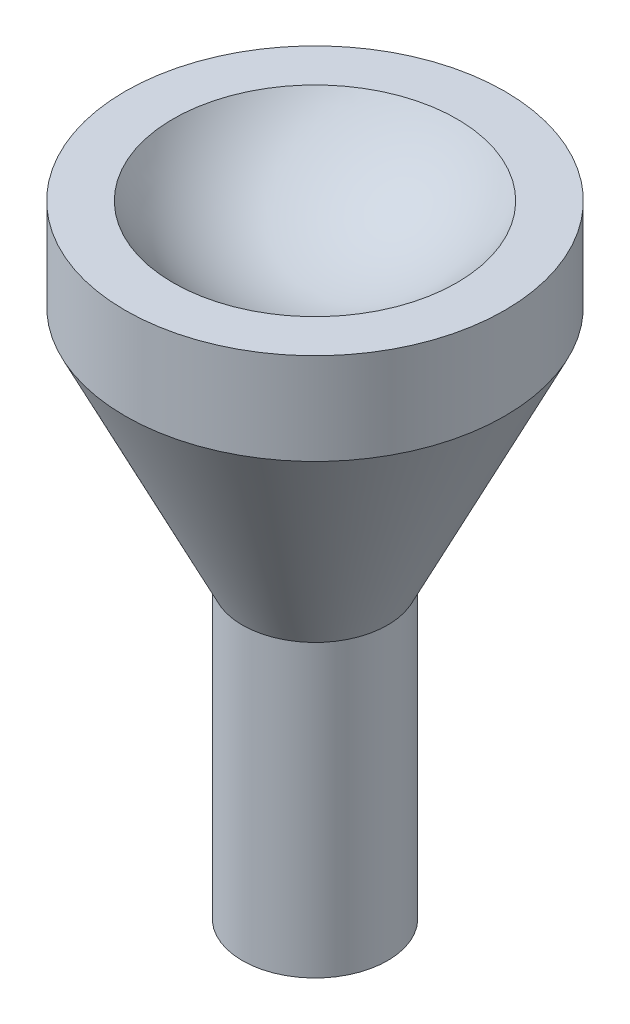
ISO-10303-21;
HEADER;
FILE_DESCRIPTION(('STEP AP214'),'2;1');
FILE_NAME('part.step','',(''),(''),'','','');
FILE_SCHEMA(('AUTOMOTIVE_DESIGN { 1 0 10303 214 1 1 1 1 }'));
ENDSEC;
DATA;
#1=APPLICATION_CONTEXT('core data for automotive mechanical design processes');
#2=APPLICATION_PROTOCOL_DEFINITION('international standard','automotive_design',2000,#1);
#3=PRODUCT_CONTEXT('',#1,'mechanical');
#4=PRODUCT('Part','Part','',(#3));
#5=PRODUCT_RELATED_PRODUCT_CATEGORY('part','',(#4));
#6=PRODUCT_DEFINITION_FORMATION('','',#4);
#7=PRODUCT_DEFINITION_CONTEXT('part definition',#1,'design');
#8=PRODUCT_DEFINITION('design','',#6,#7);
#9=PRODUCT_DEFINITION_SHAPE('','',#8);
#10=(LENGTH_UNIT() NAMED_UNIT(*) SI_UNIT(.MILLI.,.METRE.));
#11=(NAMED_UNIT(*) PLANE_ANGLE_UNIT() SI_UNIT($,.RADIAN.));
#12=(NAMED_UNIT(*) SI_UNIT($,.STERADIAN.) SOLID_ANGLE_UNIT());
#13=UNCERTAINTY_MEASURE_WITH_UNIT(LENGTH_MEASURE(1.E-05),#10,'distance_accuracy_value','');
#14=(GEOMETRIC_REPRESENTATION_CONTEXT(3) GLOBAL_UNCERTAINTY_ASSIGNED_CONTEXT((#13)) GLOBAL_UNIT_ASSIGNED_CONTEXT((#10,
#11,#12)) REPRESENTATION_CONTEXT('',''));
#15=CARTESIAN_POINT('',(0.,0.,0.));
#16=DIRECTION('',(0.,0.,1.));
#17=DIRECTION('',(1.,0.,0.));
#18=AXIS2_PLACEMENT_3D('',#15,#16,#17);
#19=CARTESIAN_POINT('',(0.,0.,0.));
#20=DIRECTION('',(0.,1.,0.));
#21=DIRECTION('',(0.,0.,1.));
#22=AXIS2_PLACEMENT_3D('',#19,#20,#21);
#23=PLANE('',#22);
#24=CARTESIAN_POINT('',(0.,0.,0.));
#25=DIRECTION('',(0.,1.,0.));
#26=DIRECTION('',(0.,0.,1.));
#27=AXIS2_PLACEMENT_3D('',#24,#25,#26);
#28=CIRCLE('',#27,2.5);
#29=CARTESIAN_POINT('',(0.,0.,2.5));
#30=VERTEX_POINT('',#29);
#31=EDGE_CURVE('E10',#30,#30,#28,.T.);
#32=ORIENTED_EDGE('',*,*,#31,.F.);
#33=EDGE_LOOP('',(#32));
#34=FACE_BOUND('',#33,.T.);
#35=ADVANCED_FACE('F29',(#34),#23,.F.);
#36=CARTESIAN_POINT('',(0.,18.6902085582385,0.));
#37=DIRECTION('',(0.,1.,0.));
#38=DIRECTION('',(0.,0.,1.));
#39=AXIS2_PLACEMENT_3D('',#36,#37,#38);
#40=CYLINDRICAL_SURFACE('',#39,2.5);
#41=CARTESIAN_POINT('',(0.,10.,0.));
#42=DIRECTION('',(0.,1.,0.));
#43=DIRECTION('',(0.,0.,1.));
#44=AXIS2_PLACEMENT_3D('',#41,#42,#43);
#45=CIRCLE('',#44,2.5);
#46=CARTESIAN_POINT('',(0.,10.,2.5));
#47=VERTEX_POINT('',#46);
#48=EDGE_CURVE('E35',#47,#47,#45,.T.);
#49=ORIENTED_EDGE('',*,*,#48,.F.);
#50=EDGE_LOOP('',(#49));
#51=FACE_BOUND('',#50,.T.);
#52=ORIENTED_EDGE('',*,*,#31,.T.);
#53=EDGE_LOOP('',(#52));
#54=FACE_BOUND('',#53,.T.);
#55=ADVANCED_FACE('F68',(#51,#54),#40,.T.);
#56=CARTESIAN_POINT('',(0.,10.,0.));
#57=DIRECTION('',(0.,1.,0.));
#58=DIRECTION('',(0.,0.,1.));
#59=AXIS2_PLACEMENT_3D('',#56,#57,#58);
#60=CONICAL_SURFACE('',#59,2.5,0.454706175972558);
#61=CARTESIAN_POINT('',(0.,18.2431227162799,0.));
#62=DIRECTION('',(0.,1.,0.));
#63=DIRECTION('',(0.,0.,1.));
#64=AXIS2_PLACEMENT_3D('',#61,#62,#63);
#65=CIRCLE('',#64,6.52983732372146);
#66=CARTESIAN_POINT('',(0.,18.2431227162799,6.52983732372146));
#67=VERTEX_POINT('',#66);
#68=EDGE_CURVE('E39',#67,#67,#65,.T.);
#69=ORIENTED_EDGE('',*,*,#68,.F.);
#70=EDGE_LOOP('',(#69));
#71=FACE_BOUND('',#70,.T.);
#72=ORIENTED_EDGE('',*,*,#48,.T.);
#73=EDGE_LOOP('',(#72));
#74=FACE_BOUND('',#73,.T.);
#75=ADVANCED_FACE('F63',(#71,#74),#60,.T.);
#76=CARTESIAN_POINT('',(0.,18.6902085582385,0.));
#77=DIRECTION('',(0.,1.,0.));
#78=DIRECTION('',(0.,0.,1.));
#79=AXIS2_PLACEMENT_3D('',#76,#77,#78);
#80=CYLINDRICAL_SURFACE('',#79,6.52983732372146);
#81=CARTESIAN_POINT('',(0.,21.3945282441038,0.));
#82=DIRECTION('',(0.,1.,0.));
#83=DIRECTION('',(0.,0.,1.));
#84=AXIS2_PLACEMENT_3D('',#81,#82,#83);
#85=CIRCLE('',#84,6.52983732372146);
#86=CARTESIAN_POINT('',(0.,21.3945282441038,6.52983732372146));
#87=VERTEX_POINT('',#86);
#88=EDGE_CURVE('E43',#87,#87,#85,.T.);
#89=ORIENTED_EDGE('',*,*,#88,.F.);
#90=EDGE_LOOP('',(#89));
#91=FACE_BOUND('',#90,.T.);
#92=ORIENTED_EDGE('',*,*,#68,.T.);
#93=EDGE_LOOP('',(#92));
#94=FACE_BOUND('',#93,.T.);
#95=ADVANCED_FACE('F57',(#91,#94),#80,.T.);
#96=CARTESIAN_POINT('',(6.52983732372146,21.3945282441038,0.));
#97=DIRECTION('',(0.,-1.,0.));
#98=DIRECTION('',(0.,0.,-1.));
#99=AXIS2_PLACEMENT_3D('',#96,#97,#98);
#100=PLANE('',#99);
#101=CARTESIAN_POINT('',(0.,21.3945282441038,0.));
#102=DIRECTION('',(0.,1.,0.));
#103=DIRECTION('',(0.,0.,1.));
#104=AXIS2_PLACEMENT_3D('',#101,#102,#103);
#105=CIRCLE('',#104,4.88358070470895);
#106=CARTESIAN_POINT('',(0.,21.3945282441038,4.88358070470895));
#107=VERTEX_POINT('',#106);
#108=EDGE_CURVE('E48',#107,#107,#105,.T.);
#109=ORIENTED_EDGE('',*,*,#108,.F.);
#110=EDGE_LOOP('',(#109));
#111=FACE_BOUND('',#110,.T.);
#112=ORIENTED_EDGE('',*,*,#88,.T.);
#113=EDGE_LOOP('',(#112));
#114=FACE_BOUND('',#113,.T.);
#115=ADVANCED_FACE('F54',(#111,#114),#100,.F.);
#116=CARTESIAN_POINT('',(0.,24.4518619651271,0.));
#117=DIRECTION('',(0.,1.,0.));
#118=DIRECTION('',(1.,0.,0.));
#119=AXIS2_PLACEMENT_3D('',#116,#117,#118);
#120=SPHERICAL_SURFACE('',#119,5.76165340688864);
#121=ORIENTED_EDGE('',*,*,#108,.T.);
#122=EDGE_LOOP('',(#121));
#123=FACE_BOUND('',#122,.T.);
#124=ADVANCED_FACE('F52',(#123),#120,.F.);
#125=CLOSED_SHELL('',(#35,#55,#75,#95,#115,#124));
#126=MANIFOLD_SOLID_BREP('B2',#125);
#127=ADVANCED_BREP_SHAPE_REPRESENTATION('',(#18,#126),#14);
#128=SHAPE_DEFINITION_REPRESENTATION(#9,#127);
ENDSEC;
END-ISO-10303-21;
